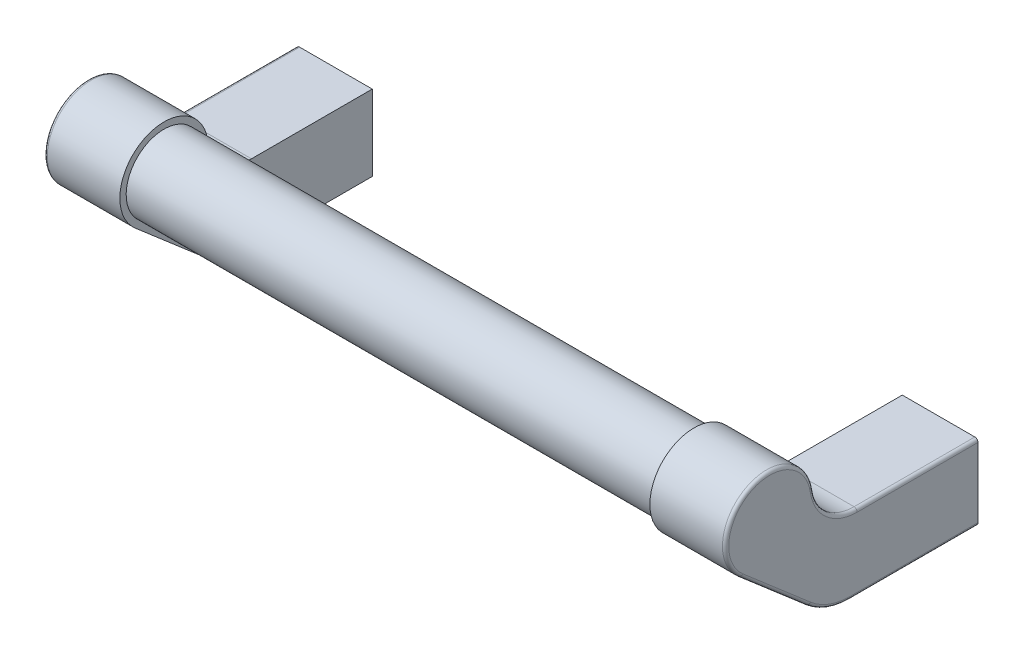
ISO-10303-21;
HEADER;
FILE_DESCRIPTION(('STEP AP214'),'2;1');
FILE_NAME('part.step','',(''),(''),'','','');
FILE_SCHEMA(('AUTOMOTIVE_DESIGN { 1 0 10303 214 1 1 1 1 }'));
ENDSEC;
DATA;
#1=APPLICATION_CONTEXT('core data for automotive mechanical design processes');
#2=APPLICATION_PROTOCOL_DEFINITION('international standard','automotive_design',2000,#1);
#3=PRODUCT_CONTEXT('',#1,'mechanical');
#4=PRODUCT('Part','Part','',(#3));
#5=PRODUCT_RELATED_PRODUCT_CATEGORY('part','',(#4));
#6=PRODUCT_DEFINITION_FORMATION('','',#4);
#7=PRODUCT_DEFINITION_CONTEXT('part definition',#1,'design');
#8=PRODUCT_DEFINITION('design','',#6,#7);
#9=PRODUCT_DEFINITION_SHAPE('','',#8);
#10=(LENGTH_UNIT() NAMED_UNIT(*) SI_UNIT(.MILLI.,.METRE.));
#11=(NAMED_UNIT(*) PLANE_ANGLE_UNIT() SI_UNIT($,.RADIAN.));
#12=(NAMED_UNIT(*) SI_UNIT($,.STERADIAN.) SOLID_ANGLE_UNIT());
#13=UNCERTAINTY_MEASURE_WITH_UNIT(LENGTH_MEASURE(1.E-05),#10,'distance_accuracy_value','');
#14=(GEOMETRIC_REPRESENTATION_CONTEXT(3) GLOBAL_UNCERTAINTY_ASSIGNED_CONTEXT((#13)) GLOBAL_UNIT_ASSIGNED_CONTEXT((#10,
#11,#12)) REPRESENTATION_CONTEXT('',''));
#15=CARTESIAN_POINT('',(0.,0.,0.));
#16=DIRECTION('',(0.,0.,1.));
#17=DIRECTION('',(1.,0.,0.));
#18=AXIS2_PLACEMENT_3D('',#15,#16,#17);
#19=CARTESIAN_POINT('',(96.,0.,6.));
#20=DIRECTION('',(0.,0.,-1.));
#21=DIRECTION('',(-1.,0.,0.));
#22=AXIS2_PLACEMENT_3D('',#19,#20,#21);
#23=PLANE('',#22);
#24=CARTESIAN_POINT('',(96.,0.,6.));
#25=DIRECTION('',(0.,0.,-1.));
#26=DIRECTION('',(-1.,0.,0.));
#27=AXIS2_PLACEMENT_3D('',#24,#25,#26);
#28=CIRCLE('',#27,2.);
#29=CARTESIAN_POINT('',(94.,0.,6.));
#30=VERTEX_POINT('',#29);
#31=EDGE_CURVE('E124',#30,#30,#28,.T.);
#32=ORIENTED_EDGE('',*,*,#31,.T.);
#33=EDGE_LOOP('',(#32));
#34=FACE_BOUND('',#33,.T.);
#35=ADVANCED_FACE('F14',(#34),#23,.T.);
#36=CARTESIAN_POINT('',(101.5,13.,19.143593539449));
#37=DIRECTION('',(-1.,0.,0.));
#38=DIRECTION('',(0.,-1.,0.));
#39=AXIS2_PLACEMENT_3D('',#36,#37,#38);
#40=TOROIDAL_SURFACE('',#39,7.5,0.5);
#41=CARTESIAN_POINT('',(101.5,5.5,19.143593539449));
#42=DIRECTION('',(0.,0.,1.));
#43=DIRECTION('',(1.,0.,0.));
#44=AXIS2_PLACEMENT_3D('',#41,#42,#43);
#45=CIRCLE('',#44,0.5);
#46=CARTESIAN_POINT('',(101.5,6.,19.143593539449));
#47=VERTEX_POINT('',#46);
#48=CARTESIAN_POINT('',(102.,5.5,19.143593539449));
#49=VERTEX_POINT('',#48);
#50=EDGE_CURVE('E275',#47,#49,#45,.F.);
#51=ORIENTED_EDGE('',*,*,#50,.F.);
#52=CARTESIAN_POINT('',(101.5,13.,19.143593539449));
#53=DIRECTION('',(-1.,0.,0.));
#54=DIRECTION('',(0.,-1.,0.));
#55=AXIS2_PLACEMENT_3D('',#52,#53,#54);
#56=CIRCLE('',#55,7.);
#57=CARTESIAN_POINT('',(101.5,12.,26.0717967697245));
#58=VERTEX_POINT('',#57);
#59=EDGE_CURVE('E102',#47,#58,#56,.T.);
#60=ORIENTED_EDGE('',*,*,#59,.T.);
#61=CARTESIAN_POINT('',(101.5,11.9285714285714,26.5666684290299));
#62=DIRECTION('',(0.,0.989743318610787,0.142857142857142));
#63=DIRECTION('',(0.,-0.142857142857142,0.989743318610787));
#64=AXIS2_PLACEMENT_3D('',#61,#62,#63);
#65=CIRCLE('',#64,0.5);
#66=CARTESIAN_POINT('',(102.,11.9285714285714,26.5666684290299));
#67=VERTEX_POINT('',#66);
#68=EDGE_CURVE('E106',#58,#67,#65,.F.);
#69=ORIENTED_EDGE('',*,*,#68,.T.);
#70=CARTESIAN_POINT('',(102.,13.,19.143593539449));
#71=DIRECTION('',(1.,0.,0.));
#72=DIRECTION('',(0.,-0.142857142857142,0.989743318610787));
#73=AXIS2_PLACEMENT_3D('',#70,#71,#72);
#74=CIRCLE('',#73,7.5);
#75=EDGE_CURVE('E292',#67,#49,#74,.T.);
#76=ORIENTED_EDGE('',*,*,#75,.T.);
#77=EDGE_LOOP('',(#51,#60,#69,#76));
#78=FACE_BOUND('',#77,.T.);
#79=ADVANCED_FACE('F161',(#78),#40,.T.);
#80=CARTESIAN_POINT('',(101.5,11.,33.));
#81=DIRECTION('',(-1.,0.,0.));
#82=DIRECTION('',(0.,-1.,0.));
#83=AXIS2_PLACEMENT_3D('',#80,#81,#82);
#84=TOROIDAL_SURFACE('',#83,6.5,0.5);
#85=ORIENTED_EDGE('',*,*,#68,.F.);
#86=CARTESIAN_POINT('',(101.5,11.,33.));
#87=DIRECTION('',(-1.,0.,0.));
#88=DIRECTION('',(0.,-1.,0.));
#89=AXIS2_PLACEMENT_3D('',#86,#87,#88);
#90=CIRCLE('',#89,7.);
#91=CARTESIAN_POINT('',(101.5,5.69800597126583,37.5704331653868));
#92=VERTEX_POINT('',#91);
#93=EDGE_CURVE('E113',#58,#92,#90,.F.);
#94=ORIENTED_EDGE('',*,*,#93,.T.);
#95=CARTESIAN_POINT('',(101.5,6.07671983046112,37.2439736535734));
#96=DIRECTION('',(0.,0.652919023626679,0.757427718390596));
#97=DIRECTION('',(0.,-0.757427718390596,0.652919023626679));
#98=AXIS2_PLACEMENT_3D('',#95,#96,#97);
#99=CIRCLE('',#98,0.5);
#100=CARTESIAN_POINT('',(102.,6.07671983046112,37.2439736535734));
#101=VERTEX_POINT('',#100);
#102=EDGE_CURVE('E116',#92,#101,#99,.T.);
#103=ORIENTED_EDGE('',*,*,#102,.T.);
#104=CARTESIAN_POINT('',(102.,11.,33.));
#105=DIRECTION('',(-1.,0.,0.));
#106=DIRECTION('',(0.,-0.757427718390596,0.652919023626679));
#107=AXIS2_PLACEMENT_3D('',#104,#105,#106);
#108=CIRCLE('',#107,6.5);
#109=EDGE_CURVE('E309',#101,#67,#108,.T.);
#110=ORIENTED_EDGE('',*,*,#109,.T.);
#111=EDGE_LOOP('',(#85,#94,#103,#110));
#112=FACE_BOUND('',#111,.T.);
#113=ADVANCED_FACE('F167',(#112),#84,.T.);
#114=CARTESIAN_POINT('',(101.5,0.0767934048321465,30.2836762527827));
#115=DIRECTION('',(0.,-0.65291902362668,-0.757427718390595));
#116=DIRECTION('',(0.,0.757427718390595,-0.65291902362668));
#117=AXIS2_PLACEMENT_3D('',#114,#115,#116);
#118=CYLINDRICAL_SURFACE('',#117,0.5);
#119=ORIENTED_EDGE('',*,*,#102,.F.);
#120=DIRECTION('',(0.,-0.65291902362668,-0.757427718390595));
#121=VECTOR('',#120,1.);
#122=CARTESIAN_POINT('',(101.5,-0.301920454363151,30.610135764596));
#123=LINE('',#122,#121);
#124=CARTESIAN_POINT('',(101.5,-3.57427718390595,26.8139932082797));
#125=VERTEX_POINT('',#124);
#126=EDGE_CURVE('E119',#92,#125,#123,.T.);
#127=ORIENTED_EDGE('',*,*,#126,.T.);
#128=CARTESIAN_POINT('',(101.5,-3.19556332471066,26.4875336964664));
#129=DIRECTION('',(0.,-0.65291902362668,-0.757427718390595));
#130=DIRECTION('',(0.,0.757427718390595,-0.65291902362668));
#131=AXIS2_PLACEMENT_3D('',#128,#129,#130);
#132=CIRCLE('',#131,0.5);
#133=CARTESIAN_POINT('',(102.,-3.19556332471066,26.4875336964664));
#134=VERTEX_POINT('',#133);
#135=EDGE_CURVE('E122',#125,#134,#132,.F.);
#136=ORIENTED_EDGE('',*,*,#135,.T.);
#137=DIRECTION('',(0.,0.65291902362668,0.757427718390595));
#138=VECTOR('',#137,1.);
#139=CARTESIAN_POINT('',(102.,-3.19556332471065,26.4875336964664));
#140=LINE('',#139,#138);
#141=EDGE_CURVE('E316',#134,#101,#140,.T.);
#142=ORIENTED_EDGE('',*,*,#141,.T.);
#143=EDGE_LOOP('',(#119,#127,#136,#142));
#144=FACE_BOUND('',#143,.T.);
#145=ADVANCED_FACE('F221',(#144),#118,.T.);
#146=CARTESIAN_POINT('',(101.5,4.,20.284802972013));
#147=DIRECTION('',(-1.,0.,0.));
#148=DIRECTION('',(0.,-1.,0.));
#149=AXIS2_PLACEMENT_3D('',#146,#147,#148);
#150=TOROIDAL_SURFACE('',#149,9.5,0.5);
#151=ORIENTED_EDGE('',*,*,#135,.F.);
#152=CARTESIAN_POINT('',(101.5,4.,20.284802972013));
#153=DIRECTION('',(-1.,0.,0.));
#154=DIRECTION('',(0.,-1.,0.));
#155=AXIS2_PLACEMENT_3D('',#152,#153,#154);
#156=CIRCLE('',#155,10.);
#157=CARTESIAN_POINT('',(101.5,-6.,20.284802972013));
#158=VERTEX_POINT('',#157);
#159=EDGE_CURVE('E125',#125,#158,#156,.F.);
#160=ORIENTED_EDGE('',*,*,#159,.T.);
#161=CARTESIAN_POINT('',(101.5,-5.5,20.284802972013));
#162=DIRECTION('',(0.,0.,1.));
#163=DIRECTION('',(0.,-1.,0.));
#164=AXIS2_PLACEMENT_3D('',#161,#162,#163);
#165=CIRCLE('',#164,0.5);
#166=CARTESIAN_POINT('',(102.,-5.5,20.284802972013));
#167=VERTEX_POINT('',#166);
#168=EDGE_CURVE('E126',#158,#167,#165,.T.);
#169=ORIENTED_EDGE('',*,*,#168,.T.);
#170=CARTESIAN_POINT('',(102.,4.,20.284802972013));
#171=DIRECTION('',(-1.,0.,0.));
#172=DIRECTION('',(0.,-1.,0.));
#173=AXIS2_PLACEMENT_3D('',#170,#171,#172);
#174=CIRCLE('',#173,9.5);
#175=EDGE_CURVE('E262',#167,#134,#174,.T.);
#176=ORIENTED_EDGE('',*,*,#175,.T.);
#177=EDGE_LOOP('',(#151,#160,#169,#176));
#178=FACE_BOUND('',#177,.T.);
#179=ADVANCED_FACE('F215',(#178),#150,.T.);
#180=CARTESIAN_POINT('',(101.5,-5.5,19.143593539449));
#181=DIRECTION('',(0.,0.,-1.));
#182=DIRECTION('',(-1.,0.,0.));
#183=AXIS2_PLACEMENT_3D('',#180,#181,#182);
#184=CYLINDRICAL_SURFACE('',#183,0.5);
#185=ORIENTED_EDGE('',*,*,#168,.F.);
#186=DIRECTION('',(0.,0.,-1.));
#187=VECTOR('',#186,1.);
#188=CARTESIAN_POINT('',(101.5,-6.,19.143593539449));
#189=LINE('',#188,#187);
#190=CARTESIAN_POINT('',(101.5,-6.,0.));
#191=VERTEX_POINT('',#190);
#192=EDGE_CURVE('E86',#158,#191,#189,.T.);
#193=ORIENTED_EDGE('',*,*,#192,.T.);
#194=CARTESIAN_POINT('',(101.5,-5.5,0.));
#195=DIRECTION('',(0.,0.,-1.));
#196=DIRECTION('',(-1.,0.,0.));
#197=AXIS2_PLACEMENT_3D('',#194,#195,#196);
#198=CIRCLE('',#197,0.5);
#199=CARTESIAN_POINT('',(102.,-5.5,0.));
#200=VERTEX_POINT('',#199);
#201=EDGE_CURVE('E130',#191,#200,#198,.F.);
#202=ORIENTED_EDGE('',*,*,#201,.T.);
#203=DIRECTION('',(0.,0.,1.));
#204=VECTOR('',#203,1.);
#205=CARTESIAN_POINT('',(102.,-5.5,19.143593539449));
#206=LINE('',#205,#204);
#207=EDGE_CURVE('E319',#200,#167,#206,.T.);
#208=ORIENTED_EDGE('',*,*,#207,.T.);
#209=EDGE_LOOP('',(#185,#193,#202,#208));
#210=FACE_BOUND('',#209,.T.);
#211=ADVANCED_FACE('F184',(#210),#184,.T.);
#212=CARTESIAN_POINT('',(102.,13.,19.143593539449));
#213=DIRECTION('',(-1.,0.,0.));
#214=DIRECTION('',(0.,-1.,0.));
#215=AXIS2_PLACEMENT_3D('',#212,#213,#214);
#216=PLANE('',#215);
#217=DIRECTION('',(0.,0.,1.));
#218=VECTOR('',#217,1.);
#219=CARTESIAN_POINT('',(102.,5.5,19.143593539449));
#220=LINE('',#219,#218);
#221=CARTESIAN_POINT('',(102.,5.5,0.));
#222=VERTEX_POINT('',#221);
#223=EDGE_CURVE('E312',#49,#222,#220,.F.);
#224=ORIENTED_EDGE('',*,*,#223,.F.);
#225=ORIENTED_EDGE('',*,*,#75,.F.);
#226=ORIENTED_EDGE('',*,*,#109,.F.);
#227=ORIENTED_EDGE('',*,*,#141,.F.);
#228=ORIENTED_EDGE('',*,*,#175,.F.);
#229=ORIENTED_EDGE('',*,*,#207,.F.);
#230=DIRECTION('',(0.,-1.,0.));
#231=VECTOR('',#230,1.);
#232=CARTESIAN_POINT('',(102.,13.,0.));
#233=LINE('',#232,#231);
#234=EDGE_CURVE('E139',#222,#200,#233,.T.);
#235=ORIENTED_EDGE('',*,*,#234,.F.);
#236=EDGE_LOOP('',(#224,#225,#226,#227,#228,#229,#235));
#237=FACE_BOUND('',#236,.T.);
#238=ADVANCED_FACE('F175',(#237),#216,.F.);
#239=CARTESIAN_POINT('',(96.,0.,6.));
#240=DIRECTION('',(0.,0.,-1.));
#241=DIRECTION('',(-1.,0.,0.));
#242=AXIS2_PLACEMENT_3D('',#239,#240,#241);
#243=CYLINDRICAL_SURFACE('',#242,2.);
#244=CARTESIAN_POINT('',(96.,0.,0.399999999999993));
#245=DIRECTION('',(0.,0.,1.));
#246=DIRECTION('',(1.,0.,0.));
#247=AXIS2_PLACEMENT_3D('',#244,#245,#246);
#248=CIRCLE('',#247,2.);
#249=CARTESIAN_POINT('',(98.,0.,0.399999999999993));
#250=VERTEX_POINT('',#249);
#251=EDGE_CURVE('E23',#250,#250,#248,.F.);
#252=ORIENTED_EDGE('',*,*,#251,.T.);
#253=EDGE_LOOP('',(#252));
#254=FACE_BOUND('',#253,.T.);
#255=ORIENTED_EDGE('',*,*,#31,.F.);
#256=EDGE_LOOP('',(#255));
#257=FACE_BOUND('',#256,.T.);
#258=ADVANCED_FACE('F147',(#254,#257),#243,.F.);
#259=CARTESIAN_POINT('',(101.5,5.5,19.143593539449));
#260=DIRECTION('',(0.,0.,1.));
#261=DIRECTION('',(1.,0.,0.));
#262=AXIS2_PLACEMENT_3D('',#259,#260,#261);
#263=CYLINDRICAL_SURFACE('',#262,0.5);
#264=ORIENTED_EDGE('',*,*,#50,.T.);
#265=ORIENTED_EDGE('',*,*,#223,.T.);
#266=CARTESIAN_POINT('',(101.5,5.5,0.));
#267=DIRECTION('',(0.,0.,1.));
#268=DIRECTION('',(1.,0.,0.));
#269=AXIS2_PLACEMENT_3D('',#266,#267,#268);
#270=CIRCLE('',#269,0.5);
#271=CARTESIAN_POINT('',(101.5,6.,0.));
#272=VERTEX_POINT('',#271);
#273=EDGE_CURVE('E31',#222,#272,#270,.T.);
#274=ORIENTED_EDGE('',*,*,#273,.T.);
#275=DIRECTION('',(0.,0.,1.));
#276=VECTOR('',#275,1.);
#277=CARTESIAN_POINT('',(101.5,6.,19.143593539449));
#278=LINE('',#277,#276);
#279=EDGE_CURVE('E105',#272,#47,#278,.T.);
#280=ORIENTED_EDGE('',*,*,#279,.T.);
#281=EDGE_LOOP('',(#264,#265,#274,#280));
#282=FACE_BOUND('',#281,.T.);
#283=ADVANCED_FACE('F170',(#282),#263,.T.);
#284=CARTESIAN_POINT('',(102.,13.,19.143593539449));
#285=DIRECTION('',(-1.,0.,0.));
#286=DIRECTION('',(0.,-1.,0.));
#287=AXIS2_PLACEMENT_3D('',#284,#285,#286);
#288=CYLINDRICAL_SURFACE('',#287,7.);
#289=ORIENTED_EDGE('',*,*,#59,.F.);
#290=DIRECTION('',(1.,0.,0.));
#291=VECTOR('',#290,1.);
#292=CARTESIAN_POINT('',(102.,6.,19.143593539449));
#293=LINE('',#292,#291);
#294=CARTESIAN_POINT('',(90.,6.,19.143593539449));
#295=VERTEX_POINT('',#294);
#296=EDGE_CURVE('E107',#47,#295,#293,.F.);
#297=ORIENTED_EDGE('',*,*,#296,.T.);
#298=CARTESIAN_POINT('',(90.,13.,19.143593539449));
#299=DIRECTION('',(-1.,0.,0.));
#300=DIRECTION('',(0.,-1.,0.));
#301=AXIS2_PLACEMENT_3D('',#298,#299,#300);
#302=CIRCLE('',#301,7.);
#303=CARTESIAN_POINT('',(90.,12.,26.0717967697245));
#304=VERTEX_POINT('',#303);
#305=EDGE_CURVE('E95',#304,#295,#302,.F.);
#306=ORIENTED_EDGE('',*,*,#305,.F.);
#307=DIRECTION('',(-1.,0.,0.));
#308=VECTOR('',#307,1.);
#309=CARTESIAN_POINT('',(102.,12.,26.0717967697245));
#310=LINE('',#309,#308);
#311=EDGE_CURVE('E78',#58,#304,#310,.T.);
#312=ORIENTED_EDGE('',*,*,#311,.F.);
#313=EDGE_LOOP('',(#289,#297,#306,#312));
#314=FACE_BOUND('',#313,.T.);
#315=ADVANCED_FACE('F180',(#314),#288,.F.);
#316=CARTESIAN_POINT('',(102.,11.,33.));
#317=DIRECTION('',(-1.,0.,0.));
#318=DIRECTION('',(0.,-1.,0.));
#319=AXIS2_PLACEMENT_3D('',#316,#317,#318);
#320=CYLINDRICAL_SURFACE('',#319,7.);
#321=ORIENTED_EDGE('',*,*,#311,.T.);
#322=CARTESIAN_POINT('',(90.,11.,33.));
#323=DIRECTION('',(-1.,0.,0.));
#324=DIRECTION('',(0.,-1.,0.));
#325=AXIS2_PLACEMENT_3D('',#322,#323,#324);
#326=CIRCLE('',#325,7.);
#327=CARTESIAN_POINT('',(90.,5.69800597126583,37.5704331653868));
#328=VERTEX_POINT('',#327);
#329=EDGE_CURVE('E97',#328,#304,#326,.T.);
#330=ORIENTED_EDGE('',*,*,#329,.F.);
#331=DIRECTION('',(-1.,0.,0.));
#332=VECTOR('',#331,1.);
#333=CARTESIAN_POINT('',(102.,5.69800597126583,37.5704331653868));
#334=LINE('',#333,#332);
#335=EDGE_CURVE('E112',#328,#92,#334,.F.);
#336=ORIENTED_EDGE('',*,*,#335,.T.);
#337=ORIENTED_EDGE('',*,*,#93,.F.);
#338=EDGE_LOOP('',(#321,#330,#336,#337));
#339=FACE_BOUND('',#338,.T.);
#340=ADVANCED_FACE('F197',(#339),#320,.T.);
#341=CARTESIAN_POINT('',(102.,-3.57427718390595,26.8139932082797));
#342=DIRECTION('',(0.,0.757427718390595,-0.65291902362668));
#343=DIRECTION('',(0.,0.65291902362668,0.757427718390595));
#344=AXIS2_PLACEMENT_3D('',#341,#342,#343);
#345=PLANE('',#344);
#346=ORIENTED_EDGE('',*,*,#126,.F.);
#347=ORIENTED_EDGE('',*,*,#335,.F.);
#348=DIRECTION('',(0.,0.65291902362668,0.757427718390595));
#349=VECTOR('',#348,1.);
#350=CARTESIAN_POINT('',(90.,-3.57427718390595,26.8139932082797));
#351=LINE('',#350,#349);
#352=CARTESIAN_POINT('',(90.,-3.57427718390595,26.8139932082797));
#353=VERTEX_POINT('',#352);
#354=EDGE_CURVE('E77',#353,#328,#351,.T.);
#355=ORIENTED_EDGE('',*,*,#354,.F.);
#356=DIRECTION('',(1.,0.,0.));
#357=VECTOR('',#356,1.);
#358=CARTESIAN_POINT('',(102.,-3.57427718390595,26.8139932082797));
#359=LINE('',#358,#357);
#360=EDGE_CURVE('E73',#125,#353,#359,.F.);
#361=ORIENTED_EDGE('',*,*,#360,.F.);
#362=EDGE_LOOP('',(#346,#347,#355,#361));
#363=FACE_BOUND('',#362,.T.);
#364=ADVANCED_FACE('F190',(#363),#345,.F.);
#365=CARTESIAN_POINT('',(102.,4.,20.284802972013));
#366=DIRECTION('',(-1.,0.,0.));
#367=DIRECTION('',(0.,-1.,0.));
#368=AXIS2_PLACEMENT_3D('',#365,#366,#367);
#369=CYLINDRICAL_SURFACE('',#368,10.);
#370=ORIENTED_EDGE('',*,*,#360,.T.);
#371=CARTESIAN_POINT('',(90.,4.,20.284802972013));
#372=DIRECTION('',(-1.,0.,0.));
#373=DIRECTION('',(0.,-1.,0.));
#374=AXIS2_PLACEMENT_3D('',#371,#372,#373);
#375=CIRCLE('',#374,10.);
#376=CARTESIAN_POINT('',(90.,-6.,20.284802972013));
#377=VERTEX_POINT('',#376);
#378=EDGE_CURVE('E66',#377,#353,#375,.T.);
#379=ORIENTED_EDGE('',*,*,#378,.F.);
#380=DIRECTION('',(-1.,0.,0.));
#381=VECTOR('',#380,1.);
#382=CARTESIAN_POINT('',(102.,-6.,20.284802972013));
#383=LINE('',#382,#381);
#384=EDGE_CURVE('E70',#377,#158,#383,.F.);
#385=ORIENTED_EDGE('',*,*,#384,.T.);
#386=ORIENTED_EDGE('',*,*,#159,.F.);
#387=EDGE_LOOP('',(#370,#379,#385,#386));
#388=FACE_BOUND('',#387,.T.);
#389=ADVANCED_FACE('F68',(#388),#369,.T.);
#390=CARTESIAN_POINT('',(102.,-6.,20.284802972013));
#391=DIRECTION('',(0.,1.,0.));
#392=DIRECTION('',(-1.,0.,0.));
#393=AXIS2_PLACEMENT_3D('',#390,#391,#392);
#394=PLANE('',#393);
#395=ORIENTED_EDGE('',*,*,#192,.F.);
#396=ORIENTED_EDGE('',*,*,#384,.F.);
#397=DIRECTION('',(0.,0.,1.));
#398=VECTOR('',#397,1.);
#399=CARTESIAN_POINT('',(90.,-6.,20.284802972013));
#400=LINE('',#399,#398);
#401=CARTESIAN_POINT('',(90.,-6.,0.));
#402=VERTEX_POINT('',#401);
#403=EDGE_CURVE('E84',#402,#377,#400,.T.);
#404=ORIENTED_EDGE('',*,*,#403,.F.);
#405=DIRECTION('',(1.,0.,0.));
#406=VECTOR('',#405,1.);
#407=CARTESIAN_POINT('',(102.,-6.,0.));
#408=LINE('',#407,#406);
#409=EDGE_CURVE('E132',#402,#191,#408,.T.);
#410=ORIENTED_EDGE('',*,*,#409,.T.);
#411=EDGE_LOOP('',(#395,#396,#404,#410));
#412=FACE_BOUND('',#411,.T.);
#413=ADVANCED_FACE('F82',(#412),#394,.F.);
#414=CARTESIAN_POINT('',(102.,-6.,0.));
#415=DIRECTION('',(0.,0.,1.));
#416=DIRECTION('',(1.,0.,0.));
#417=AXIS2_PLACEMENT_3D('',#414,#415,#416);
#418=PLANE('',#417);
#419=CARTESIAN_POINT('',(96.,0.,0.));
#420=DIRECTION('',(0.,0.,1.));
#421=DIRECTION('',(1.,0.,0.));
#422=AXIS2_PLACEMENT_3D('',#419,#420,#421);
#423=CIRCLE('',#422,2.4);
#424=CARTESIAN_POINT('',(98.4,0.,0.));
#425=VERTEX_POINT('',#424);
#426=EDGE_CURVE('E9',#425,#425,#423,.T.);
#427=ORIENTED_EDGE('',*,*,#426,.T.);
#428=EDGE_LOOP('',(#427));
#429=FACE_BOUND('',#428,.T.);
#430=ORIENTED_EDGE('',*,*,#273,.F.);
#431=ORIENTED_EDGE('',*,*,#234,.T.);
#432=ORIENTED_EDGE('',*,*,#201,.F.);
#433=ORIENTED_EDGE('',*,*,#409,.F.);
#434=DIRECTION('',(0.,1.,0.));
#435=VECTOR('',#434,1.);
#436=CARTESIAN_POINT('',(90.,-6.,0.));
#437=LINE('',#436,#435);
#438=CARTESIAN_POINT('',(90.,6.,0.));
#439=VERTEX_POINT('',#438);
#440=EDGE_CURVE('E94',#439,#402,#437,.F.);
#441=ORIENTED_EDGE('',*,*,#440,.F.);
#442=DIRECTION('',(1.,0.,0.));
#443=VECTOR('',#442,1.);
#444=CARTESIAN_POINT('',(102.,6.,0.));
#445=LINE('',#444,#443);
#446=EDGE_CURVE('E129',#272,#439,#445,.F.);
#447=ORIENTED_EDGE('',*,*,#446,.F.);
#448=EDGE_LOOP('',(#430,#431,#432,#433,#441,#447));
#449=FACE_BOUND('',#448,.T.);
#450=ADVANCED_FACE('F183',(#429,#449),#418,.F.);
#451=CARTESIAN_POINT('',(102.,6.,0.));
#452=DIRECTION('',(0.,-1.,0.));
#453=DIRECTION('',(1.,0.,0.));
#454=AXIS2_PLACEMENT_3D('',#451,#452,#453);
#455=PLANE('',#454);
#456=ORIENTED_EDGE('',*,*,#279,.F.);
#457=ORIENTED_EDGE('',*,*,#446,.T.);
#458=DIRECTION('',(0.,0.,1.));
#459=VECTOR('',#458,1.);
#460=CARTESIAN_POINT('',(90.,6.,0.));
#461=LINE('',#460,#459);
#462=EDGE_CURVE('E88',#295,#439,#461,.F.);
#463=ORIENTED_EDGE('',*,*,#462,.F.);
#464=ORIENTED_EDGE('',*,*,#296,.F.);
#465=EDGE_LOOP('',(#456,#457,#463,#464));
#466=FACE_BOUND('',#465,.T.);
#467=ADVANCED_FACE('F196',(#466),#455,.F.);
#468=CARTESIAN_POINT('',(90.,13.,19.143593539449));
#469=DIRECTION('',(-1.,0.,0.));
#470=DIRECTION('',(0.,-1.,0.));
#471=AXIS2_PLACEMENT_3D('',#468,#469,#470);
#472=PLANE('',#471);
#473=CARTESIAN_POINT('',(90.,11.,33.));
#474=DIRECTION('',(-1.,0.,0.));
#475=DIRECTION('',(0.,-1.,0.));
#476=AXIS2_PLACEMENT_3D('',#473,#474,#475);
#477=CIRCLE('',#476,6.);
#478=CARTESIAN_POINT('',(90.,5.,33.));
#479=VERTEX_POINT('',#478);
#480=EDGE_CURVE('E135',#479,#479,#477,.T.);
#481=ORIENTED_EDGE('',*,*,#480,.F.);
#482=EDGE_LOOP('',(#481));
#483=FACE_BOUND('',#482,.T.);
#484=ORIENTED_EDGE('',*,*,#462,.T.);
#485=ORIENTED_EDGE('',*,*,#440,.T.);
#486=ORIENTED_EDGE('',*,*,#403,.T.);
#487=ORIENTED_EDGE('',*,*,#378,.T.);
#488=ORIENTED_EDGE('',*,*,#354,.T.);
#489=ORIENTED_EDGE('',*,*,#329,.T.);
#490=ORIENTED_EDGE('',*,*,#305,.T.);
#491=EDGE_LOOP('',(#484,#485,#486,#487,#488,#489,#490));
#492=FACE_BOUND('',#491,.T.);
#493=ADVANCED_FACE('F92',(#483,#492),#472,.T.);
#494=CARTESIAN_POINT('',(90.,11.,33.));
#495=DIRECTION('',(-1.,0.,0.));
#496=DIRECTION('',(0.,-1.,0.));
#497=AXIS2_PLACEMENT_3D('',#494,#495,#496);
#498=CYLINDRICAL_SURFACE('',#497,6.);
#499=ORIENTED_EDGE('',*,*,#480,.T.);
#500=EDGE_LOOP('',(#499));
#501=FACE_BOUND('',#500,.T.);
#502=CARTESIAN_POINT('',(6.,11.,33.));
#503=DIRECTION('',(-1.,0.,0.));
#504=DIRECTION('',(0.,-1.,0.));
#505=AXIS2_PLACEMENT_3D('',#502,#503,#504);
#506=CIRCLE('',#505,6.);
#507=CARTESIAN_POINT('',(6.,5.,33.));
#508=VERTEX_POINT('',#507);
#509=EDGE_CURVE('E676',#508,#508,#506,.T.);
#510=ORIENTED_EDGE('',*,*,#509,.F.);
#511=EDGE_LOOP('',(#510));
#512=FACE_BOUND('',#511,.T.);
#513=ADVANCED_FACE('F187',(#501,#512),#498,.T.);
#514=CARTESIAN_POINT('',(0.,0.,6.));
#515=DIRECTION('',(0.,0.,-1.));
#516=DIRECTION('',(-1.,0.,0.));
#517=AXIS2_PLACEMENT_3D('',#514,#515,#516);
#518=PLANE('',#517);
#519=CARTESIAN_POINT('',(0.,0.,6.));
#520=DIRECTION('',(0.,0.,-1.));
#521=DIRECTION('',(-1.,0.,0.));
#522=AXIS2_PLACEMENT_3D('',#519,#520,#521);
#523=CIRCLE('',#522,2.);
#524=CARTESIAN_POINT('',(-2.,0.,6.));
#525=VERTEX_POINT('',#524);
#526=EDGE_CURVE('E659',#525,#525,#523,.T.);
#527=ORIENTED_EDGE('',*,*,#526,.T.);
#528=EDGE_LOOP('',(#527));
#529=FACE_BOUND('',#528,.T.);
#530=ADVANCED_FACE('F466',(#529),#518,.T.);
#531=CARTESIAN_POINT('',(-5.5,4.,20.284802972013));
#532=DIRECTION('',(-1.,0.,0.));
#533=DIRECTION('',(0.,-1.,0.));
#534=AXIS2_PLACEMENT_3D('',#531,#532,#533);
#535=TOROIDAL_SURFACE('',#534,9.5,0.5);
#536=CARTESIAN_POINT('',(-5.5,-3.19556332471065,26.4875336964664));
#537=DIRECTION('',(0.,0.65291902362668,0.757427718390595));
#538=DIRECTION('',(0.,-0.757427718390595,0.65291902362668));
#539=AXIS2_PLACEMENT_3D('',#536,#537,#538);
#540=CIRCLE('',#539,0.5);
#541=CARTESIAN_POINT('',(-6.,-3.19556332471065,26.4875336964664));
#542=VERTEX_POINT('',#541);
#543=CARTESIAN_POINT('',(-5.5,-3.57427718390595,26.8139932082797));
#544=VERTEX_POINT('',#543);
#545=EDGE_CURVE('E717',#542,#544,#540,.T.);
#546=ORIENTED_EDGE('',*,*,#545,.F.);
#547=CARTESIAN_POINT('',(-6.,4.,20.284802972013));
#548=DIRECTION('',(1.,0.,0.));
#549=DIRECTION('',(0.,-0.757427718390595,0.65291902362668));
#550=AXIS2_PLACEMENT_3D('',#547,#548,#549);
#551=CIRCLE('',#550,9.50000000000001);
#552=CARTESIAN_POINT('',(-6.,-5.5,20.284802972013));
#553=VERTEX_POINT('',#552);
#554=EDGE_CURVE('E848',#553,#542,#551,.F.);
#555=ORIENTED_EDGE('',*,*,#554,.F.);
#556=CARTESIAN_POINT('',(-5.5,-5.5,20.284802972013));
#557=DIRECTION('',(0.,0.,1.));
#558=DIRECTION('',(0.,-1.,0.));
#559=AXIS2_PLACEMENT_3D('',#556,#557,#558);
#560=CIRCLE('',#559,0.5);
#561=CARTESIAN_POINT('',(-5.5,-6.,20.284802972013));
#562=VERTEX_POINT('',#561);
#563=EDGE_CURVE('E711',#553,#562,#560,.T.);
#564=ORIENTED_EDGE('',*,*,#563,.T.);
#565=CARTESIAN_POINT('',(-5.5,4.,20.284802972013));
#566=DIRECTION('',(-1.,0.,0.));
#567=DIRECTION('',(0.,-1.,0.));
#568=AXIS2_PLACEMENT_3D('',#565,#566,#567);
#569=CIRCLE('',#568,10.);
#570=EDGE_CURVE('E714',#562,#544,#569,.T.);
#571=ORIENTED_EDGE('',*,*,#570,.T.);
#572=EDGE_LOOP('',(#546,#555,#564,#571));
#573=FACE_BOUND('',#572,.T.);
#574=ADVANCED_FACE('F475',(#573),#535,.T.);
#575=CARTESIAN_POINT('',(-5.5,-3.19556332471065,26.4875336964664));
#576=DIRECTION('',(0.,0.65291902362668,0.757427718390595));
#577=DIRECTION('',(0.,-0.757427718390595,0.65291902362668));
#578=AXIS2_PLACEMENT_3D('',#575,#576,#577);
#579=CYLINDRICAL_SURFACE('',#578,0.5);
#580=CARTESIAN_POINT('',(-5.5,6.07671983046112,37.2439736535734));
#581=DIRECTION('',(0.,0.652919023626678,0.757427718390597));
#582=DIRECTION('',(0.,-0.757427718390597,0.652919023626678));
#583=AXIS2_PLACEMENT_3D('',#580,#581,#582);
#584=CIRCLE('',#583,0.5);
#585=CARTESIAN_POINT('',(-6.,6.07671983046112,37.2439736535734));
#586=VERTEX_POINT('',#585);
#587=CARTESIAN_POINT('',(-5.5,5.69800597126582,37.5704331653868));
#588=VERTEX_POINT('',#587);
#589=EDGE_CURVE('E724',#586,#588,#584,.T.);
#590=ORIENTED_EDGE('',*,*,#589,.F.);
#591=DIRECTION('',(0.,0.65291902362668,0.757427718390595));
#592=VECTOR('',#591,1.);
#593=CARTESIAN_POINT('',(-6.,-3.19556332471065,26.4875336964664));
#594=LINE('',#593,#592);
#595=EDGE_CURVE('E839',#542,#586,#594,.T.);
#596=ORIENTED_EDGE('',*,*,#595,.F.);
#597=ORIENTED_EDGE('',*,*,#545,.T.);
#598=DIRECTION('',(0.,0.65291902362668,0.757427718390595));
#599=VECTOR('',#598,1.);
#600=CARTESIAN_POINT('',(-5.5,-3.57427718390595,26.8139932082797));
#601=LINE('',#600,#599);
#602=EDGE_CURVE('E721',#544,#588,#601,.T.);
#603=ORIENTED_EDGE('',*,*,#602,.T.);
#604=EDGE_LOOP('',(#590,#596,#597,#603));
#605=FACE_BOUND('',#604,.T.);
#606=ADVANCED_FACE('F484',(#605),#579,.T.);
#607=CARTESIAN_POINT('',(-5.5,11.,33.));
#608=DIRECTION('',(-1.,0.,0.));
#609=DIRECTION('',(0.,-1.,0.));
#610=AXIS2_PLACEMENT_3D('',#607,#608,#609);
#611=TOROIDAL_SURFACE('',#610,6.5,0.5);
#612=CARTESIAN_POINT('',(-5.5,11.9285714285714,26.5666684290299));
#613=DIRECTION('',(0.,-0.989743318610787,-0.142857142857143));
#614=DIRECTION('',(0.,0.142857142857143,-0.989743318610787));
#615=AXIS2_PLACEMENT_3D('',#612,#613,#614);
#616=CIRCLE('',#615,0.5);
#617=CARTESIAN_POINT('',(-5.5,12.,26.0717967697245));
#618=VERTEX_POINT('',#617);
#619=CARTESIAN_POINT('',(-6.,11.9285714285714,26.5666684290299));
#620=VERTEX_POINT('',#619);
#621=EDGE_CURVE('E732',#618,#620,#616,.F.);
#622=ORIENTED_EDGE('',*,*,#621,.T.);
#623=CARTESIAN_POINT('',(-6.,11.,33.));
#624=DIRECTION('',(1.,0.,0.));
#625=DIRECTION('',(0.,0.142857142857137,-0.989743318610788));
#626=AXIS2_PLACEMENT_3D('',#623,#624,#625);
#627=CIRCLE('',#626,6.50000000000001);
#628=EDGE_CURVE('E842',#586,#620,#627,.F.);
#629=ORIENTED_EDGE('',*,*,#628,.F.);
#630=ORIENTED_EDGE('',*,*,#589,.T.);
#631=CARTESIAN_POINT('',(-5.5,11.,33.));
#632=DIRECTION('',(-1.,0.,0.));
#633=DIRECTION('',(0.,-1.,0.));
#634=AXIS2_PLACEMENT_3D('',#631,#632,#633);
#635=CIRCLE('',#634,7.);
#636=EDGE_CURVE('E729',#588,#618,#635,.T.);
#637=ORIENTED_EDGE('',*,*,#636,.T.);
#638=EDGE_LOOP('',(#622,#629,#630,#637));
#639=FACE_BOUND('',#638,.T.);
#640=ADVANCED_FACE('F494',(#639),#611,.T.);
#641=CARTESIAN_POINT('',(-5.5,13.,19.143593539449));
#642=DIRECTION('',(-1.,0.,0.));
#643=DIRECTION('',(0.,-1.,0.));
#644=AXIS2_PLACEMENT_3D('',#641,#642,#643);
#645=TOROIDAL_SURFACE('',#644,7.5,0.5);
#646=CARTESIAN_POINT('',(-5.5,5.5,19.143593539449));
#647=DIRECTION('',(0.,0.,-1.));
#648=DIRECTION('',(-1.,0.,0.));
#649=AXIS2_PLACEMENT_3D('',#646,#647,#648);
#650=CIRCLE('',#649,0.5);
#651=CARTESIAN_POINT('',(-6.,5.5,19.143593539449));
#652=VERTEX_POINT('',#651);
#653=CARTESIAN_POINT('',(-5.5,6.,19.143593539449));
#654=VERTEX_POINT('',#653);
#655=EDGE_CURVE('E708',#652,#654,#650,.T.);
#656=ORIENTED_EDGE('',*,*,#655,.F.);
#657=CARTESIAN_POINT('',(-6.,13.,19.143593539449));
#658=DIRECTION('',(-1.,0.,0.));
#659=DIRECTION('',(0.,-1.,0.));
#660=AXIS2_PLACEMENT_3D('',#657,#658,#659);
#661=CIRCLE('',#660,7.5);
#662=EDGE_CURVE('E748',#620,#652,#661,.F.);
#663=ORIENTED_EDGE('',*,*,#662,.F.);
#664=ORIENTED_EDGE('',*,*,#621,.F.);
#665=CARTESIAN_POINT('',(-5.5,13.,19.143593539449));
#666=DIRECTION('',(-1.,0.,0.));
#667=DIRECTION('',(0.,-1.,0.));
#668=AXIS2_PLACEMENT_3D('',#665,#666,#667);
#669=CIRCLE('',#668,7.);
#670=EDGE_CURVE('E686',#618,#654,#669,.F.);
#671=ORIENTED_EDGE('',*,*,#670,.T.);
#672=EDGE_LOOP('',(#656,#663,#664,#671));
#673=FACE_BOUND('',#672,.T.);
#674=ADVANCED_FACE('F504',(#673),#645,.T.);
#675=CARTESIAN_POINT('',(-6.,13.,19.143593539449));
#676=DIRECTION('',(-1.,0.,0.));
#677=DIRECTION('',(0.,-1.,0.));
#678=AXIS2_PLACEMENT_3D('',#675,#676,#677);
#679=PLANE('',#678);
#680=ORIENTED_EDGE('',*,*,#595,.T.);
#681=ORIENTED_EDGE('',*,*,#628,.T.);
#682=ORIENTED_EDGE('',*,*,#662,.T.);
#683=DIRECTION('',(0.,0.,1.));
#684=VECTOR('',#683,1.);
#685=CARTESIAN_POINT('',(-6.,5.5,19.143593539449));
#686=LINE('',#685,#684);
#687=CARTESIAN_POINT('',(-6.,5.5,0.));
#688=VERTEX_POINT('',#687);
#689=EDGE_CURVE('E757',#652,#688,#686,.F.);
#690=ORIENTED_EDGE('',*,*,#689,.T.);
#691=DIRECTION('',(0.,-1.,0.));
#692=VECTOR('',#691,1.);
#693=CARTESIAN_POINT('',(-6.,13.,0.));
#694=LINE('',#693,#692);
#695=CARTESIAN_POINT('',(-6.,-5.5,0.));
#696=VERTEX_POINT('',#695);
#697=EDGE_CURVE('E754',#688,#696,#694,.T.);
#698=ORIENTED_EDGE('',*,*,#697,.T.);
#699=DIRECTION('',(0.,0.,1.));
#700=VECTOR('',#699,1.);
#701=CARTESIAN_POINT('',(-6.,-5.5,19.143593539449));
#702=LINE('',#701,#700);
#703=EDGE_CURVE('E758',#696,#553,#702,.T.);
#704=ORIENTED_EDGE('',*,*,#703,.T.);
#705=ORIENTED_EDGE('',*,*,#554,.T.);
#706=EDGE_LOOP('',(#680,#681,#682,#690,#698,#704,#705));
#707=FACE_BOUND('',#706,.T.);
#708=ADVANCED_FACE('F514',(#707),#679,.T.);
#709=CARTESIAN_POINT('',(-5.5,-5.5,20.284802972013));
#710=DIRECTION('',(0.,0.,1.));
#711=DIRECTION('',(1.,0.,0.));
#712=AXIS2_PLACEMENT_3D('',#709,#710,#711);
#713=CYLINDRICAL_SURFACE('',#712,0.5);
#714=ORIENTED_EDGE('',*,*,#563,.F.);
#715=ORIENTED_EDGE('',*,*,#703,.F.);
#716=CARTESIAN_POINT('',(-5.5,-5.5,0.));
#717=DIRECTION('',(0.,0.,1.));
#718=DIRECTION('',(1.,0.,0.));
#719=AXIS2_PLACEMENT_3D('',#716,#717,#718);
#720=CIRCLE('',#719,0.5);
#721=CARTESIAN_POINT('',(-5.5,-6.,0.));
#722=VERTEX_POINT('',#721);
#723=EDGE_CURVE('E690',#696,#722,#720,.T.);
#724=ORIENTED_EDGE('',*,*,#723,.T.);
#725=DIRECTION('',(0.,0.,1.));
#726=VECTOR('',#725,1.);
#727=CARTESIAN_POINT('',(-5.5,-6.,20.284802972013));
#728=LINE('',#727,#726);
#729=EDGE_CURVE('E693',#722,#562,#728,.T.);
#730=ORIENTED_EDGE('',*,*,#729,.T.);
#731=EDGE_LOOP('',(#714,#715,#724,#730));
#732=FACE_BOUND('',#731,.T.);
#733=ADVANCED_FACE('F524',(#732),#713,.T.);
#734=CARTESIAN_POINT('',(-5.5,5.5,0.));
#735=DIRECTION('',(0.,0.,-1.));
#736=DIRECTION('',(-1.,0.,0.));
#737=AXIS2_PLACEMENT_3D('',#734,#735,#736);
#738=CYLINDRICAL_SURFACE('',#737,0.5);
#739=ORIENTED_EDGE('',*,*,#655,.T.);
#740=DIRECTION('',(0.,0.,-1.));
#741=VECTOR('',#740,1.);
#742=CARTESIAN_POINT('',(-5.5,6.,0.));
#743=LINE('',#742,#741);
#744=CARTESIAN_POINT('',(-5.5,6.,0.));
#745=VERTEX_POINT('',#744);
#746=EDGE_CURVE('E705',#654,#745,#743,.T.);
#747=ORIENTED_EDGE('',*,*,#746,.T.);
#748=CARTESIAN_POINT('',(-5.5,5.5,0.));
#749=DIRECTION('',(0.,0.,-1.));
#750=DIRECTION('',(-1.,0.,0.));
#751=AXIS2_PLACEMENT_3D('',#748,#749,#750);
#752=CIRCLE('',#751,0.5);
#753=EDGE_CURVE('E687',#745,#688,#752,.F.);
#754=ORIENTED_EDGE('',*,*,#753,.T.);
#755=ORIENTED_EDGE('',*,*,#689,.F.);
#756=EDGE_LOOP('',(#739,#747,#754,#755));
#757=FACE_BOUND('',#756,.T.);
#758=ADVANCED_FACE('F534',(#757),#738,.T.);
#759=CARTESIAN_POINT('',(0.,0.,6.));
#760=DIRECTION('',(0.,0.,-1.));
#761=DIRECTION('',(-1.,0.,0.));
#762=AXIS2_PLACEMENT_3D('',#759,#760,#761);
#763=CYLINDRICAL_SURFACE('',#762,2.);
#764=CARTESIAN_POINT('',(0.,0.,0.399999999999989));
#765=DIRECTION('',(0.,0.,1.));
#766=DIRECTION('',(1.,0.,0.));
#767=AXIS2_PLACEMENT_3D('',#764,#765,#766);
#768=CIRCLE('',#767,2.);
#769=CARTESIAN_POINT('',(2.,0.,0.399999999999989));
#770=VERTEX_POINT('',#769);
#771=EDGE_CURVE('E138',#770,#770,#768,.F.);
#772=ORIENTED_EDGE('',*,*,#771,.T.);
#773=EDGE_LOOP('',(#772));
#774=FACE_BOUND('',#773,.T.);
#775=ORIENTED_EDGE('',*,*,#526,.F.);
#776=EDGE_LOOP('',(#775));
#777=FACE_BOUND('',#776,.T.);
#778=ADVANCED_FACE('F544',(#774,#777),#763,.F.);
#779=CARTESIAN_POINT('',(6.,-6.,20.284802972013));
#780=DIRECTION('',(0.,1.,0.));
#781=DIRECTION('',(-1.,0.,0.));
#782=AXIS2_PLACEMENT_3D('',#779,#780,#781);
#783=PLANE('',#782);
#784=ORIENTED_EDGE('',*,*,#729,.F.);
#785=DIRECTION('',(1.,0.,0.));
#786=VECTOR('',#785,1.);
#787=CARTESIAN_POINT('',(6.,-6.,0.));
#788=LINE('',#787,#786);
#789=CARTESIAN_POINT('',(6.,-6.,0.));
#790=VERTEX_POINT('',#789);
#791=EDGE_CURVE('E703',#722,#790,#788,.T.);
#792=ORIENTED_EDGE('',*,*,#791,.T.);
#793=DIRECTION('',(0.,0.,1.));
#794=VECTOR('',#793,1.);
#795=CARTESIAN_POINT('',(6.,-6.,20.284802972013));
#796=LINE('',#795,#794);
#797=CARTESIAN_POINT('',(6.,-6.,20.284802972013));
#798=VERTEX_POINT('',#797);
#799=EDGE_CURVE('E698',#798,#790,#796,.F.);
#800=ORIENTED_EDGE('',*,*,#799,.F.);
#801=DIRECTION('',(-1.,0.,0.));
#802=VECTOR('',#801,1.);
#803=CARTESIAN_POINT('',(6.,-6.,20.284802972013));
#804=LINE('',#803,#802);
#805=EDGE_CURVE('E680',#562,#798,#804,.F.);
#806=ORIENTED_EDGE('',*,*,#805,.F.);
#807=EDGE_LOOP('',(#784,#792,#800,#806));
#808=FACE_BOUND('',#807,.T.);
#809=ADVANCED_FACE('F554',(#808),#783,.F.);
#810=CARTESIAN_POINT('',(6.,4.,20.284802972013));
#811=DIRECTION('',(-1.,0.,0.));
#812=DIRECTION('',(0.,-1.,0.));
#813=AXIS2_PLACEMENT_3D('',#810,#811,#812);
#814=CYLINDRICAL_SURFACE('',#813,10.);
#815=ORIENTED_EDGE('',*,*,#805,.T.);
#816=CARTESIAN_POINT('',(6.,4.,20.284802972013));
#817=DIRECTION('',(-1.,0.,0.));
#818=DIRECTION('',(0.,-1.,0.));
#819=AXIS2_PLACEMENT_3D('',#816,#817,#818);
#820=CIRCLE('',#819,10.);
#821=CARTESIAN_POINT('',(6.,-3.57427718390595,26.8139932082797));
#822=VERTEX_POINT('',#821);
#823=EDGE_CURVE('E677',#798,#822,#820,.T.);
#824=ORIENTED_EDGE('',*,*,#823,.T.);
#825=DIRECTION('',(1.,0.,0.));
#826=VECTOR('',#825,1.);
#827=CARTESIAN_POINT('',(6.,-3.57427718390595,26.8139932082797));
#828=LINE('',#827,#826);
#829=EDGE_CURVE('E696',#822,#544,#828,.F.);
#830=ORIENTED_EDGE('',*,*,#829,.T.);
#831=ORIENTED_EDGE('',*,*,#570,.F.);
#832=EDGE_LOOP('',(#815,#824,#830,#831));
#833=FACE_BOUND('',#832,.T.);
#834=ADVANCED_FACE('F564',(#833),#814,.T.);
#835=CARTESIAN_POINT('',(6.,-3.57427718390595,26.8139932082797));
#836=DIRECTION('',(0.,0.757427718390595,-0.65291902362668));
#837=DIRECTION('',(0.,0.65291902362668,0.757427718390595));
#838=AXIS2_PLACEMENT_3D('',#835,#836,#837);
#839=PLANE('',#838);
#840=ORIENTED_EDGE('',*,*,#602,.F.);
#841=ORIENTED_EDGE('',*,*,#829,.F.);
#842=DIRECTION('',(0.,0.65291902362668,0.757427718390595));
#843=VECTOR('',#842,1.);
#844=CARTESIAN_POINT('',(6.,-3.57427718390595,26.8139932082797));
#845=LINE('',#844,#843);
#846=CARTESIAN_POINT('',(6.,5.69800597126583,37.5704331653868));
#847=VERTEX_POINT('',#846);
#848=EDGE_CURVE('E681',#847,#822,#845,.F.);
#849=ORIENTED_EDGE('',*,*,#848,.F.);
#850=DIRECTION('',(-1.,0.,0.));
#851=VECTOR('',#850,1.);
#852=CARTESIAN_POINT('',(6.,5.69800597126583,37.5704331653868));
#853=LINE('',#852,#851);
#854=EDGE_CURVE('E685',#588,#847,#853,.F.);
#855=ORIENTED_EDGE('',*,*,#854,.F.);
#856=EDGE_LOOP('',(#840,#841,#849,#855));
#857=FACE_BOUND('',#856,.T.);
#858=ADVANCED_FACE('F574',(#857),#839,.F.);
#859=CARTESIAN_POINT('',(6.,11.,33.));
#860=DIRECTION('',(-1.,0.,0.));
#861=DIRECTION('',(0.,-1.,0.));
#862=AXIS2_PLACEMENT_3D('',#859,#860,#861);
#863=CYLINDRICAL_SURFACE('',#862,7.);
#864=ORIENTED_EDGE('',*,*,#854,.T.);
#865=CARTESIAN_POINT('',(6.,11.,33.));
#866=DIRECTION('',(-1.,0.,0.));
#867=DIRECTION('',(0.,-1.,0.));
#868=AXIS2_PLACEMENT_3D('',#865,#866,#867);
#869=CIRCLE('',#868,7.);
#870=CARTESIAN_POINT('',(6.,12.,26.0717967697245));
#871=VERTEX_POINT('',#870);
#872=EDGE_CURVE('E682',#847,#871,#869,.T.);
#873=ORIENTED_EDGE('',*,*,#872,.T.);
#874=DIRECTION('',(-1.,0.,0.));
#875=VECTOR('',#874,1.);
#876=CARTESIAN_POINT('',(6.,12.,26.0717967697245));
#877=LINE('',#876,#875);
#878=EDGE_CURVE('E720',#871,#618,#877,.T.);
#879=ORIENTED_EDGE('',*,*,#878,.T.);
#880=ORIENTED_EDGE('',*,*,#636,.F.);
#881=EDGE_LOOP('',(#864,#873,#879,#880));
#882=FACE_BOUND('',#881,.T.);
#883=ADVANCED_FACE('F584',(#882),#863,.T.);
#884=CARTESIAN_POINT('',(6.,13.,19.143593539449));
#885=DIRECTION('',(-1.,0.,0.));
#886=DIRECTION('',(0.,-1.,0.));
#887=AXIS2_PLACEMENT_3D('',#884,#885,#886);
#888=CYLINDRICAL_SURFACE('',#887,7.);
#889=ORIENTED_EDGE('',*,*,#670,.F.);
#890=ORIENTED_EDGE('',*,*,#878,.F.);
#891=CARTESIAN_POINT('',(6.,13.,19.143593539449));
#892=DIRECTION('',(-1.,0.,0.));
#893=DIRECTION('',(0.,-1.,0.));
#894=AXIS2_PLACEMENT_3D('',#891,#892,#893);
#895=CIRCLE('',#894,7.);
#896=CARTESIAN_POINT('',(6.,6.,19.143593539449));
#897=VERTEX_POINT('',#896);
#898=EDGE_CURVE('E661',#871,#897,#895,.F.);
#899=ORIENTED_EDGE('',*,*,#898,.T.);
#900=DIRECTION('',(1.,0.,0.));
#901=VECTOR('',#900,1.);
#902=CARTESIAN_POINT('',(6.,6.,19.143593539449));
#903=LINE('',#902,#901);
#904=EDGE_CURVE('E672',#897,#654,#903,.F.);
#905=ORIENTED_EDGE('',*,*,#904,.T.);
#906=EDGE_LOOP('',(#889,#890,#899,#905));
#907=FACE_BOUND('',#906,.T.);
#908=ADVANCED_FACE('F594',(#907),#888,.F.);
#909=CARTESIAN_POINT('',(6.,6.,0.));
#910=DIRECTION('',(0.,-1.,0.));
#911=DIRECTION('',(1.,0.,0.));
#912=AXIS2_PLACEMENT_3D('',#909,#910,#911);
#913=PLANE('',#912);
#914=ORIENTED_EDGE('',*,*,#746,.F.);
#915=ORIENTED_EDGE('',*,*,#904,.F.);
#916=DIRECTION('',(0.,0.,1.));
#917=VECTOR('',#916,1.);
#918=CARTESIAN_POINT('',(6.,6.,0.));
#919=LINE('',#918,#917);
#920=CARTESIAN_POINT('',(6.,6.,0.));
#921=VERTEX_POINT('',#920);
#922=EDGE_CURVE('E665',#921,#897,#919,.T.);
#923=ORIENTED_EDGE('',*,*,#922,.F.);
#924=DIRECTION('',(1.,0.,0.));
#925=VECTOR('',#924,1.);
#926=CARTESIAN_POINT('',(6.,6.,0.));
#927=LINE('',#926,#925);
#928=EDGE_CURVE('E657',#921,#745,#927,.F.);
#929=ORIENTED_EDGE('',*,*,#928,.T.);
#930=EDGE_LOOP('',(#914,#915,#923,#929));
#931=FACE_BOUND('',#930,.T.);
#932=ADVANCED_FACE('F604',(#931),#913,.F.);
#933=CARTESIAN_POINT('',(6.,-6.,0.));
#934=DIRECTION('',(0.,0.,1.));
#935=DIRECTION('',(1.,0.,0.));
#936=AXIS2_PLACEMENT_3D('',#933,#934,#935);
#937=PLANE('',#936);
#938=CARTESIAN_POINT('',(0.,0.,0.));
#939=DIRECTION('',(0.,0.,1.));
#940=DIRECTION('',(1.,0.,0.));
#941=AXIS2_PLACEMENT_3D('',#938,#939,#940);
#942=CIRCLE('',#941,2.4);
#943=CARTESIAN_POINT('',(2.4,0.,0.));
#944=VERTEX_POINT('',#943);
#945=EDGE_CURVE('E142',#944,#944,#942,.T.);
#946=ORIENTED_EDGE('',*,*,#945,.T.);
#947=EDGE_LOOP('',(#946));
#948=FACE_BOUND('',#947,.T.);
#949=ORIENTED_EDGE('',*,*,#753,.F.);
#950=ORIENTED_EDGE('',*,*,#928,.F.);
#951=DIRECTION('',(0.,1.,0.));
#952=VECTOR('',#951,1.);
#953=CARTESIAN_POINT('',(6.,-6.,0.));
#954=LINE('',#953,#952);
#955=EDGE_CURVE('E701',#790,#921,#954,.T.);
#956=ORIENTED_EDGE('',*,*,#955,.F.);
#957=ORIENTED_EDGE('',*,*,#791,.F.);
#958=ORIENTED_EDGE('',*,*,#723,.F.);
#959=ORIENTED_EDGE('',*,*,#697,.F.);
#960=EDGE_LOOP('',(#949,#950,#956,#957,#958,#959));
#961=FACE_BOUND('',#960,.T.);
#962=ADVANCED_FACE('F614',(#948,#961),#937,.F.);
#963=CARTESIAN_POINT('',(6.,13.,19.143593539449));
#964=DIRECTION('',(-1.,0.,0.));
#965=DIRECTION('',(0.,-1.,0.));
#966=AXIS2_PLACEMENT_3D('',#963,#964,#965);
#967=PLANE('',#966);
#968=ORIENTED_EDGE('',*,*,#509,.T.);
#969=EDGE_LOOP('',(#968));
#970=FACE_BOUND('',#969,.T.);
#971=ORIENTED_EDGE('',*,*,#955,.T.);
#972=ORIENTED_EDGE('',*,*,#922,.T.);
#973=ORIENTED_EDGE('',*,*,#898,.F.);
#974=ORIENTED_EDGE('',*,*,#872,.F.);
#975=ORIENTED_EDGE('',*,*,#848,.T.);
#976=ORIENTED_EDGE('',*,*,#823,.F.);
#977=ORIENTED_EDGE('',*,*,#799,.T.);
#978=EDGE_LOOP('',(#971,#972,#973,#974,#975,#976,#977));
#979=FACE_BOUND('',#978,.T.);
#980=ADVANCED_FACE('F157',(#970,#979),#967,.F.);
#981=CARTESIAN_POINT('',(0.,0.,0.399999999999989));
#982=DIRECTION('',(0.,0.,-1.));
#983=DIRECTION('',(-1.,0.,0.));
#984=AXIS2_PLACEMENT_3D('',#981,#982,#983);
#985=CONICAL_SURFACE('',#984,2.,0.785398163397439);
#986=ORIENTED_EDGE('',*,*,#945,.F.);
#987=EDGE_LOOP('',(#986));
#988=FACE_BOUND('',#987,.T.);
#989=ORIENTED_EDGE('',*,*,#771,.F.);
#990=EDGE_LOOP('',(#989));
#991=FACE_BOUND('',#990,.T.);
#992=ADVANCED_FACE('F151',(#988,#991),#985,.F.);
#993=CARTESIAN_POINT('',(96.,0.,0.399999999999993));
#994=DIRECTION('',(0.,0.,-1.));
#995=DIRECTION('',(-1.,0.,0.));
#996=AXIS2_PLACEMENT_3D('',#993,#994,#995);
#997=CONICAL_SURFACE('',#996,2.,0.785398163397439);
#998=ORIENTED_EDGE('',*,*,#426,.F.);
#999=EDGE_LOOP('',(#998));
#1000=FACE_BOUND('',#999,.T.);
#1001=ORIENTED_EDGE('',*,*,#251,.F.);
#1002=EDGE_LOOP('',(#1001));
#1003=FACE_BOUND('',#1002,.T.);
#1004=ADVANCED_FACE('F16',(#1000,#1003),#997,.F.);
#1005=CLOSED_SHELL('',(#35,#79,#113,#145,#179,#211,#238,#258,#283,#315,#340,#364,#389,#413,#450,
#467,#493,#513,#530,#574,#606,#640,#674,#708,#733,#758,#778,#809,#834,#858,#883,#908,#932,#962,
#980,#992,#1004));
#1006=MANIFOLD_SOLID_BREP('B1',#1005);
#1007=ADVANCED_BREP_SHAPE_REPRESENTATION('',(#18,#1006),#14);
#1008=SHAPE_DEFINITION_REPRESENTATION(#9,#1007);
ENDSEC;
END-ISO-10303-21;
